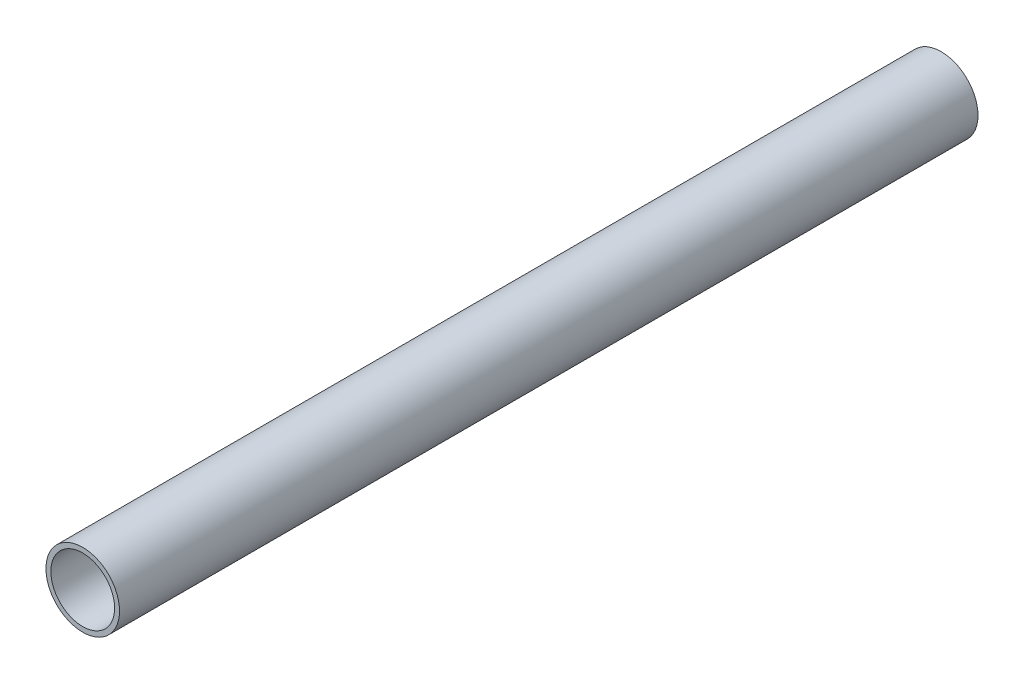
ISO-10303-21;
HEADER;
FILE_DESCRIPTION(('STEP AP214'),'2;1');
FILE_NAME('part.step','',(''),(''),'','','');
FILE_SCHEMA(('AUTOMOTIVE_DESIGN { 1 0 10303 214 1 1 1 1 }'));
ENDSEC;
DATA;
#1=APPLICATION_CONTEXT('core data for automotive mechanical design processes');
#2=APPLICATION_PROTOCOL_DEFINITION('international standard','automotive_design',2000,#1);
#3=PRODUCT_CONTEXT('',#1,'mechanical');
#4=PRODUCT('Part','Part','',(#3));
#5=PRODUCT_RELATED_PRODUCT_CATEGORY('part','',(#4));
#6=PRODUCT_DEFINITION_FORMATION('','',#4);
#7=PRODUCT_DEFINITION_CONTEXT('part definition',#1,'design');
#8=PRODUCT_DEFINITION('design','',#6,#7);
#9=PRODUCT_DEFINITION_SHAPE('','',#8);
#10=(LENGTH_UNIT() NAMED_UNIT(*) SI_UNIT(.MILLI.,.METRE.));
#11=(NAMED_UNIT(*) PLANE_ANGLE_UNIT() SI_UNIT($,.RADIAN.));
#12=(NAMED_UNIT(*) SI_UNIT($,.STERADIAN.) SOLID_ANGLE_UNIT());
#13=UNCERTAINTY_MEASURE_WITH_UNIT(LENGTH_MEASURE(1.E-05),#10,'distance_accuracy_value','');
#14=(GEOMETRIC_REPRESENTATION_CONTEXT(3) GLOBAL_UNCERTAINTY_ASSIGNED_CONTEXT((#13)) GLOBAL_UNIT_ASSIGNED_CONTEXT((#10,
#11,#12)) REPRESENTATION_CONTEXT('',''));
#15=CARTESIAN_POINT('',(0.,0.,0.));
#16=DIRECTION('',(0.,0.,1.));
#17=DIRECTION('',(1.,0.,0.));
#18=AXIS2_PLACEMENT_3D('',#15,#16,#17);
#19=CARTESIAN_POINT('',(0.,0.,700.));
#20=DIRECTION('',(0.,0.,-1.));
#21=DIRECTION('',(-1.,0.,0.));
#22=AXIS2_PLACEMENT_3D('',#19,#20,#21);
#23=CYLINDRICAL_SURFACE('',#22,25.);
#24=CARTESIAN_POINT('',(0.,0.,70.));
#25=DIRECTION('',(0.,0.,-1.));
#26=DIRECTION('',(-1.,0.,0.));
#27=AXIS2_PLACEMENT_3D('',#24,#25,#26);
#28=CIRCLE('',#27,25.);
#29=CARTESIAN_POINT('',(-25.,0.,70.));
#30=VERTEX_POINT('',#29);
#31=EDGE_CURVE('E48',#30,#30,#28,.T.);
#32=ORIENTED_EDGE('',*,*,#31,.T.);
#33=EDGE_LOOP('',(#32));
#34=FACE_BOUND('',#33,.T.);
#35=CARTESIAN_POINT('',(0.,0.,630.));
#36=DIRECTION('',(0.,0.,1.));
#37=DIRECTION('',(1.,0.,0.));
#38=AXIS2_PLACEMENT_3D('',#35,#36,#37);
#39=CIRCLE('',#38,25.);
#40=CARTESIAN_POINT('',(25.,0.,630.));
#41=VERTEX_POINT('',#40);
#42=EDGE_CURVE('E57',#41,#41,#39,.T.);
#43=ORIENTED_EDGE('',*,*,#42,.T.);
#44=EDGE_LOOP('',(#43));
#45=FACE_BOUND('',#44,.T.);
#46=ADVANCED_FACE('F28',(#34,#45),#23,.F.);
#47=CARTESIAN_POINT('',(0.,0.,700.));
#48=DIRECTION('',(0.,0.,1.));
#49=DIRECTION('',(1.,0.,0.));
#50=AXIS2_PLACEMENT_3D('',#47,#48,#49);
#51=PLANE('',#50);
#52=CARTESIAN_POINT('',(0.,0.,700.));
#53=DIRECTION('',(0.,0.,1.));
#54=DIRECTION('',(1.,0.,0.));
#55=AXIS2_PLACEMENT_3D('',#52,#53,#54);
#56=CIRCLE('',#55,26.);
#57=CARTESIAN_POINT('',(26.,0.,700.));
#58=VERTEX_POINT('',#57);
#59=EDGE_CURVE('E54',#58,#58,#56,.T.);
#60=ORIENTED_EDGE('',*,*,#59,.F.);
#61=EDGE_LOOP('',(#60));
#62=FACE_BOUND('',#61,.T.);
#63=CARTESIAN_POINT('',(0.,0.,700.));
#64=DIRECTION('',(0.,0.,1.));
#65=DIRECTION('',(1.,0.,0.));
#66=AXIS2_PLACEMENT_3D('',#63,#64,#65);
#67=CIRCLE('',#66,30.);
#68=CARTESIAN_POINT('',(30.,0.,700.));
#69=VERTEX_POINT('',#68);
#70=EDGE_CURVE('E10',#69,#69,#67,.T.);
#71=ORIENTED_EDGE('',*,*,#70,.T.);
#72=EDGE_LOOP('',(#71));
#73=FACE_BOUND('',#72,.T.);
#74=ADVANCED_FACE('F75',(#62,#73),#51,.T.);
#75=CARTESIAN_POINT('',(0.,0.,0.));
#76=DIRECTION('',(0.,0.,1.));
#77=DIRECTION('',(1.,0.,0.));
#78=AXIS2_PLACEMENT_3D('',#75,#76,#77);
#79=PLANE('',#78);
#80=CARTESIAN_POINT('',(0.,0.,0.));
#81=DIRECTION('',(0.,0.,-1.));
#82=DIRECTION('',(-1.,0.,0.));
#83=AXIS2_PLACEMENT_3D('',#80,#81,#82);
#84=CIRCLE('',#83,26.);
#85=CARTESIAN_POINT('',(-26.,0.,0.));
#86=VERTEX_POINT('',#85);
#87=EDGE_CURVE('E43',#86,#86,#84,.T.);
#88=ORIENTED_EDGE('',*,*,#87,.F.);
#89=EDGE_LOOP('',(#88));
#90=FACE_BOUND('',#89,.T.);
#91=CARTESIAN_POINT('',(0.,0.,0.));
#92=DIRECTION('',(0.,0.,1.));
#93=DIRECTION('',(1.,0.,0.));
#94=AXIS2_PLACEMENT_3D('',#91,#92,#93);
#95=CIRCLE('',#94,30.);
#96=CARTESIAN_POINT('',(30.,0.,0.));
#97=VERTEX_POINT('',#96);
#98=EDGE_CURVE('E35',#97,#97,#95,.T.);
#99=ORIENTED_EDGE('',*,*,#98,.F.);
#100=EDGE_LOOP('',(#99));
#101=FACE_BOUND('',#100,.T.);
#102=ADVANCED_FACE('F77',(#90,#101),#79,.F.);
#103=CARTESIAN_POINT('',(0.,0.,700.));
#104=DIRECTION('',(0.,0.,-1.));
#105=DIRECTION('',(-1.,0.,0.));
#106=AXIS2_PLACEMENT_3D('',#103,#104,#105);
#107=CYLINDRICAL_SURFACE('',#106,30.);
#108=ORIENTED_EDGE('',*,*,#70,.F.);
#109=EDGE_LOOP('',(#108));
#110=FACE_BOUND('',#109,.T.);
#111=ORIENTED_EDGE('',*,*,#98,.T.);
#112=EDGE_LOOP('',(#111));
#113=FACE_BOUND('',#112,.T.);
#114=ADVANCED_FACE('F30',(#110,#113),#107,.T.);
#115=CARTESIAN_POINT('',(0.,0.,70.));
#116=DIRECTION('',(0.,0.,-1.));
#117=DIRECTION('',(-1.,0.,0.));
#118=AXIS2_PLACEMENT_3D('',#115,#116,#117);
#119=CYLINDRICAL_SURFACE('',#118,26.);
#120=CARTESIAN_POINT('',(0.,0.,70.));
#121=DIRECTION('',(0.,0.,-1.));
#122=DIRECTION('',(-1.,0.,0.));
#123=AXIS2_PLACEMENT_3D('',#120,#121,#122);
#124=CIRCLE('',#123,26.);
#125=CARTESIAN_POINT('',(-26.,0.,70.));
#126=VERTEX_POINT('',#125);
#127=EDGE_CURVE('E39',#126,#126,#124,.T.);
#128=ORIENTED_EDGE('',*,*,#127,.F.);
#129=EDGE_LOOP('',(#128));
#130=FACE_BOUND('',#129,.T.);
#131=ORIENTED_EDGE('',*,*,#87,.T.);
#132=EDGE_LOOP('',(#131));
#133=FACE_BOUND('',#132,.T.);
#134=ADVANCED_FACE('F87',(#130,#133),#119,.F.);
#135=CARTESIAN_POINT('',(0.,0.,70.));
#136=DIRECTION('',(0.,0.,-1.));
#137=DIRECTION('',(-1.,0.,0.));
#138=AXIS2_PLACEMENT_3D('',#135,#136,#137);
#139=PLANE('',#138);
#140=ORIENTED_EDGE('',*,*,#31,.F.);
#141=EDGE_LOOP('',(#140));
#142=FACE_BOUND('',#141,.T.);
#143=ORIENTED_EDGE('',*,*,#127,.T.);
#144=EDGE_LOOP('',(#143));
#145=FACE_BOUND('',#144,.T.);
#146=ADVANCED_FACE('F71',(#142,#145),#139,.T.);
#147=CARTESIAN_POINT('',(0.,0.,630.));
#148=DIRECTION('',(0.,0.,1.));
#149=DIRECTION('',(1.,0.,0.));
#150=AXIS2_PLACEMENT_3D('',#147,#148,#149);
#151=CYLINDRICAL_SURFACE('',#150,26.);
#152=CARTESIAN_POINT('',(0.,0.,630.));
#153=DIRECTION('',(0.,0.,1.));
#154=DIRECTION('',(1.,0.,0.));
#155=AXIS2_PLACEMENT_3D('',#152,#153,#154);
#156=CIRCLE('',#155,26.);
#157=CARTESIAN_POINT('',(26.,0.,630.));
#158=VERTEX_POINT('',#157);
#159=EDGE_CURVE('E51',#158,#158,#156,.T.);
#160=ORIENTED_EDGE('',*,*,#159,.F.);
#161=EDGE_LOOP('',(#160));
#162=FACE_BOUND('',#161,.T.);
#163=ORIENTED_EDGE('',*,*,#59,.T.);
#164=EDGE_LOOP('',(#163));
#165=FACE_BOUND('',#164,.T.);
#166=ADVANCED_FACE('F65',(#162,#165),#151,.F.);
#167=CARTESIAN_POINT('',(0.,0.,630.));
#168=DIRECTION('',(0.,0.,1.));
#169=DIRECTION('',(1.,0.,0.));
#170=AXIS2_PLACEMENT_3D('',#167,#168,#169);
#171=PLANE('',#170);
#172=ORIENTED_EDGE('',*,*,#42,.F.);
#173=EDGE_LOOP('',(#172));
#174=FACE_BOUND('',#173,.T.);
#175=ORIENTED_EDGE('',*,*,#159,.T.);
#176=EDGE_LOOP('',(#175));
#177=FACE_BOUND('',#176,.T.);
#178=ADVANCED_FACE('F62',(#174,#177),#171,.T.);
#179=CLOSED_SHELL('',(#46,#74,#102,#114,#134,#146,#166,#178));
#180=MANIFOLD_SOLID_BREP('B2',#179);
#181=ADVANCED_BREP_SHAPE_REPRESENTATION('',(#18,#180),#14);
#182=SHAPE_DEFINITION_REPRESENTATION(#9,#181);
ENDSEC;
END-ISO-10303-21;
